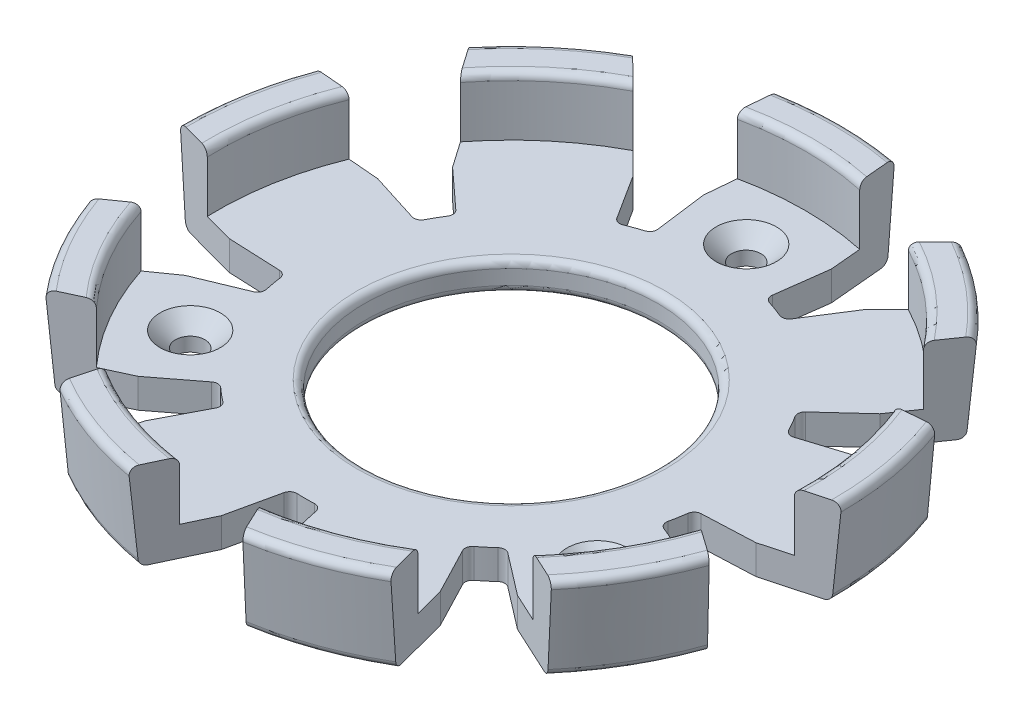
from build123d import *

# Parameters (mm, degrees)
EXTRUSION1_DEPTH                             = 2
EXTRUSION13_START                            = 4
EXTRUSION13_DEPTH                            = 4
D_POUILLE1_ANGLE                             = 5.000000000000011
CONG_75_R                                    = 0.5
R_P_TITION_CIRCULAIRE1_COUNT                 = 9
D_POUILLE1_OF_R_P_TITION_CIRCULAIRE1_2_ANGLE = 5.000000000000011
D_POUILLE1_OF_R_P_TITION_CIRCULAIRE1_3_ANGLE = 5.000000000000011
D_POUILLE1_OF_R_P_TITION_CIRCULAIRE1_4_ANGLE = 5.000000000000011
D_POUILLE1_OF_R_P_TITION_CIRCULAIRE1_5_ANGLE = 5.000000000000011
D_POUILLE1_OF_R_P_TITION_CIRCULAIRE1_6_ANGLE = 5.000000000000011
D_POUILLE1_OF_R_P_TITION_CIRCULAIRE1_7_ANGLE = 5.000000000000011
D_POUILLE1_OF_R_P_TITION_CIRCULAIRE1_8_ANGLE = 5.000000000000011
D_POUILLE1_OF_R_P_TITION_CIRCULAIRE1_9_ANGLE = 5.000000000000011
CONG_75_OF_R_P_TITION_CIRCULAIRE1_R          = 0.5
EXTRUSION11_REACH                            = 34.352
ESQUISSE11_R                                 = 10
CONG_76_R                                    = 0.5
R_P_TITION_CIRCULAIRE2_COUNT                 = 3


with BuildPart() as part:
    # Esquisse1 → Extrusion1 (new body)
    with BuildSketch(Plane(origin=(0, 2, 0), x_dir=(-1, 0, 0), z_dir=(0, 1, 0))):
        with BuildLine():
            Line((-3.8363587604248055, -13.464113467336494), (-4.358463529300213, -17.42989291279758))
            Line((-4.358463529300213, -17.42989291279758), (-3.978531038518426, -21.63726625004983))
            ThreePointArc((-3.978531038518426, -21.63726625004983), (6.9771e-12, -22), (3.978531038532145, -21.637266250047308))
            Line((3.978531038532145, -21.637266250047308), (4.35846352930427, -17.429892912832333))
            Line((4.35846352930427, -17.429892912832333), (3.8363587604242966, -13.46411346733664))
            ThreePointArc((3.8363587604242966, -13.46411346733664), (4.315076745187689, -13.318412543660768), (4.788282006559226, -13.155696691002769))
            Line((4.788282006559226, -13.155696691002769), (0, 0))
            Line((0, 0), (-4.788282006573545, -13.155696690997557))
            ThreePointArc((-4.788282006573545, -13.155696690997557), (-4.315076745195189, -13.318412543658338), (-3.8363587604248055, -13.464113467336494))
        make_face()
    extrusion1 = extrude(amount=-EXTRUSION1_DEPTH)

    # Esquisse18 → Extrusion13 (add)
    with BuildSketch(Plane(origin=(0, 2, 0), x_dir=(1, 0, 0), z_dir=(0, 1, 0)).offset(EXTRUSION13_START)):
        with BuildLine():
            Line((3.978531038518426, 21.63726625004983), (4.165994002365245, 19.561300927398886))
            ThreePointArc((4.165994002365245, 19.561300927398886), (-5.40778e-12, 19.999999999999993), (-4.1659940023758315, 19.561300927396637))
            Line((-4.1659940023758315, 19.561300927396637), (-3.9785310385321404, 21.637266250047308))
            ThreePointArc((-3.9785310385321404, 21.637266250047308), (-6.97441e-12, 22), (3.978531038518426, 21.63726625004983))
        make_face()
    extrusion13 = extrude(amount=-EXTRUSION13_DEPTH)

    # D_pouille1
    d_pouille1_faces = [part.faces().sort_by_distance(p)[0] for p in [
        (-6.98042e-12, 3, -22),
    ]]
    draft(d_pouille1_faces, Plane(origin=(0, 0, 0), x_dir=(0, 0, -1), z_dir=(0, -1, 0)), D_POUILLE1_ANGLE)

    # Cong_75
    cong_75_edges = [part.edges().sort_by_distance(p)[0] for p in [
        (3.836358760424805, 1, -13.464113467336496),
        (-6.97598e-12, 0, -22),
        (-3.8363587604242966, 1, -13.464113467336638),
        (-5.41145e-12, 6, -20),
        (-7.3983e-12, 6, -22.524931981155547),
    ]]
    fillet(cong_75_edges, radius=CONG_75_R)

    # R_p_tition circulaire1: Extrusion1, Extrusion13 ×9 about axis
    r_p_tition_circulaire1_axis = Axis((3e-17, 0, -1.3e-16), (0, 1, 0))
    add([extrusion1.rotate(r_p_tition_circulaire1_axis, i * 360 / R_P_TITION_CIRCULAIRE1_COUNT) for i in range(1, R_P_TITION_CIRCULAIRE1_COUNT)])
    add([extrusion13.rotate(r_p_tition_circulaire1_axis, i * 360 / R_P_TITION_CIRCULAIRE1_COUNT) for i in range(1, R_P_TITION_CIRCULAIRE1_COUNT)])

    # D_pouille1 of R_p_tition circulaire1 2
    d_pouille1_of_r_p_tition_circulaire1_2_faces = [part.faces().sort_by_distance(p)[0] for p in [
        (-14.14132741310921, 3, -16.85297774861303),
    ]]
    draft(d_pouille1_of_r_p_tition_circulaire1_2_faces, Plane(origin=(9e-17, 0, -1e-17), x_dir=(-0.6427876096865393, 0, -0.766044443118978), z_dir=(0, -1, 0)), D_POUILLE1_OF_R_P_TITION_CIRCULAIRE1_2_ANGLE)

    # D_pouille1 of R_p_tition circulaire1 3
    d_pouille1_of_r_p_tition_circulaire1_3_faces = [part.faces().sort_by_distance(p)[0] for p in [
        (-21.66577056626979, 3, -3.8202599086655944),
    ]]
    draft(d_pouille1_of_r_p_tition_circulaire1_3_faces, Plane(origin=(1.5e-16, 0, -8e-17), x_dir=(-0.984807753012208, 0, -0.17364817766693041), z_dir=(0, -1, 0)), D_POUILLE1_OF_R_P_TITION_CIRCULAIRE1_3_ANGLE)

    # D_pouille1 of R_p_tition circulaire1 4
    d_pouille1_of_r_p_tition_circulaire1_4_faces = [part.faces().sort_by_distance(p)[0] for p in [
        (-19.052558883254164, 3, 11.00000000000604),
    ]]
    draft(d_pouille1_of_r_p_tition_circulaire1_4_faces, Plane(origin=(1.5e-16, 0, -1.7e-16), x_dir=(-0.8660254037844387, 0, 0.4999999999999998), z_dir=(0, -1, 0)), D_POUILLE1_OF_R_P_TITION_CIRCULAIRE1_4_ANGLE)

    # D_pouille1 of R_p_tition circulaire1 5
    d_pouille1_of_r_p_tition_circulaire1_5_faces = [part.faces().sort_by_distance(p)[0] for p in [
        (-7.524443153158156, 3, 20.673237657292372),
    ]]
    draft(d_pouille1_of_r_p_tition_circulaire1_5_faces, Plane(origin=(1e-16, 0, -2.4e-16), x_dir=(-0.3420201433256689, 0, 0.9396926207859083), z_dir=(0, -1, 0)), D_POUILLE1_OF_R_P_TITION_CIRCULAIRE1_5_ANGLE)

    # D_pouille1 of R_p_tition circulaire1 6
    d_pouille1_of_r_p_tition_circulaire1_6_faces = [part.faces().sort_by_distance(p)[0] for p in [
        (7.52444315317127, 3, 20.673237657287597),
    ]]
    draft(d_pouille1_of_r_p_tition_circulaire1_6_faces, Plane(origin=(1e-17, 0, -2.6e-16), x_dir=(0.34202014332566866, 0, 0.9396926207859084), z_dir=(0, -1, 0)), D_POUILLE1_OF_R_P_TITION_CIRCULAIRE1_6_ANGLE)

    # D_pouille1 of R_p_tition circulaire1 7
    d_pouille1_of_r_p_tition_circulaire1_7_faces = [part.faces().sort_by_distance(p)[0] for p in [
        (19.052558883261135, 3, 10.999999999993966),
    ]]
    draft(d_pouille1_of_r_p_tition_circulaire1_7_faces, Plane(origin=(-7e-17, 0, -2.1e-16), x_dir=(0.8660254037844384, 0, 0.5000000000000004), z_dir=(0, -1, 0)), D_POUILLE1_OF_R_P_TITION_CIRCULAIRE1_7_ANGLE)

    # D_pouille1 of R_p_tition circulaire1 8
    d_pouille1_of_r_p_tition_circulaire1_8_faces = [part.faces().sort_by_distance(p)[0] for p in [
        (21.665770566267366, 3, -3.8202599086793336),
    ]]
    draft(d_pouille1_of_r_p_tition_circulaire1_8_faces, Plane(origin=(-1e-16, 0, -1.3e-16), x_dir=(0.9848077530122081, 0, -0.17364817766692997), z_dir=(0, -1, 0)), D_POUILLE1_OF_R_P_TITION_CIRCULAIRE1_8_ANGLE)

    # D_pouille1 of R_p_tition circulaire1 9
    d_pouille1_of_r_p_tition_circulaire1_9_faces = [part.faces().sort_by_distance(p)[0] for p in [
        (14.141327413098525, 3, -16.852977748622),
    ]]
    draft(d_pouille1_of_r_p_tition_circulaire1_9_faces, Plane(origin=(-8e-17, 0, -5e-17), x_dir=(0.6427876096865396, 0, -0.7660444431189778), z_dir=(0, -1, 0)), D_POUILLE1_OF_R_P_TITION_CIRCULAIRE1_9_ANGLE)

    # Cong_75 of R_p_tition circulaire1
    cong_75_of_r_p_tition_circulaire1_edges = [part.edges().sort_by_distance(p)[0] for p in [
        (-5.715744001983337, 1, -12.780073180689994),
        (-14.141327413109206, 0, -16.852977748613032),
        (-11.593386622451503, 1, -7.848145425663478),
        (-12.855752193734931, 6, -15.320888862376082),
        (-14.478747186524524, 6, -17.2550989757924),
        (-12.593386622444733, 1, -6.11609461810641),
        (-21.66577056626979, 0, -3.820259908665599),
        (-13.925740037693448, 1, 1.440057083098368),
        (-19.696155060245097, 6, -3.472963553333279),
        (-22.182727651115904, 6, -3.9114133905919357),
        (-13.578443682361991, 1, 3.409672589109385),
        (-19.052558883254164, 0, 11.000000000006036),
        (-9.742084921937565, 1, 10.054440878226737),
        (-17.320508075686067, 6, 10.000000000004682),
        (-19.50716331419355, 6, 11.262465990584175),
        (-8.209996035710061, 1, 11.340016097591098),
        (-7.52444315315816, 0, 20.673237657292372),
        (-0.9999999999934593, 1, 13.964240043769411),
        (-6.840402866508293, 6, 18.793852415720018),
        (-7.703980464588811, 6, 21.16651236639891),
        (0.9999999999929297, 1, 13.964240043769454),
        (7.5244431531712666, 0, 20.673237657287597),
        (8.20999603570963, 1, 11.340016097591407),
        (6.840402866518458, 6, 18.79385241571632),
        (7.70398046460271, 6, 21.16651236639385),
        (9.74208492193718, 1, 10.054440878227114),
        (19.052558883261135, 0, 10.99999999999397),
        (13.578443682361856, 1, 3.4096725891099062),
        (17.320508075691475, 6, 9.999999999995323),
        (19.50716331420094, 6, 11.262465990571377),
        (13.925740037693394, 1, 1.4400570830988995),
        (21.665770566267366, 0, -3.820259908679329),
        (12.593386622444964, 1, -6.116094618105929),
        (19.696155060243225, 6, -3.4729635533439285),
        (22.182727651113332, 6, -3.911413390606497),
        (11.593386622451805, 1, -7.848145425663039),
        (14.141327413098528, 0, -16.852977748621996),
        (5.715744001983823, 1, -12.780073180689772),
        (12.855752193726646, 6, -15.320888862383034),
        (14.478747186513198, 6, -17.25509897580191),
    ]]
    fillet(cong_75_of_r_p_tition_circulaire1_edges, radius=CONG_75_OF_R_P_TITION_CIRCULAIRE1_R)

    # Esquisse11 → Extrusion11 (cut, up to next)
    with BuildSketch(Plane.XZ, mode=Mode.PRIVATE) as extrusion11_sk1:
        with Locations(Location((0, 0, 0), (0, 0, 90))):
            Circle(ESQUISSE11_R)
    extrusion11_tool1 = extrude(extrusion11_sk1.sketch, amount=-EXTRUSION11_REACH, mode=Mode.PRIVATE) & part.part
    add(extrusion11_tool1.solids().sort_by_distance((0, 0, 0))[0], mode=Mode.SUBTRACT)

    # Esquisse12 → Per_age1 (revolve, cut)
    with BuildSketch(Plane(origin=(13.8564064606, 2, 8), x_dir=(0, 0, 1), z_dir=(1, 0, 0))):
        Polygon((0, 0), (0, 2.0010000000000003), (1, 2.0009999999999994), (1.000000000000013, 1.0540000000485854), (2.0540000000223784, -2.6e-15), align=None)
    per_age1 = revolve(axis=Axis((13.8564064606, 8.445314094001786, 8), (0, -1, 0)), mode=Mode.SUBTRACT)

    # Cong_76
    cong_76_edges = [part.edges().sort_by_distance(p)[0] for p in [
        (-1.84e-15, 2, -10),
        (-1.84e-15, 0, -10),
    ]]
    fillet(cong_76_edges, radius=CONG_76_R)

    # R_p_tition circulaire2: Per_age1 ×3 about axis
    r_p_tition_circulaire2_axis = Axis((-1.12e-15, 0, -7e-17), (0, 1, 0))
    for i in range(1, R_P_TITION_CIRCULAIRE2_COUNT):
        add(per_age1.rotate(r_p_tition_circulaire2_axis, i * 360 / R_P_TITION_CIRCULAIRE2_COUNT), mode=Mode.SUBTRACT)

    # Esquisse14 → Per_age2 (revolve, cut)
    with BuildSketch(Plane(origin=(-13.8564064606, 2, 8), x_dir=(0, 0, 1), z_dir=(1, 0, 0))):
        Polygon((0, 0), (0, 2.0310218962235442), (1, 2.0310218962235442), (1.000000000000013, 1.0540000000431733), (2.0540000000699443, -2.6e-15), align=None)
    revolve(axis=Axis((-13.8564064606, 8.445314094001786, 8), (0, -1, 0)), mode=Mode.SUBTRACT)

    # Esquisse16 → Per_age3 (revolve, cut)
    with BuildSketch(Plane(origin=(4.3e-16, 2, -16), x_dir=(0, 0, 1), z_dir=(1, 0, 0))):
        Polygon((0, 0), (0, 2.0310218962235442), (1.0000000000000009, 2.0310218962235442), (1.000000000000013, 1.054000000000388), (2.0540000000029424, -2.6e-15), align=None)
    revolve(axis=Axis((4.3e-16, 8.445314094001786, -16), (0, -1, 0)), mode=Mode.SUBTRACT)


solid = part.part
